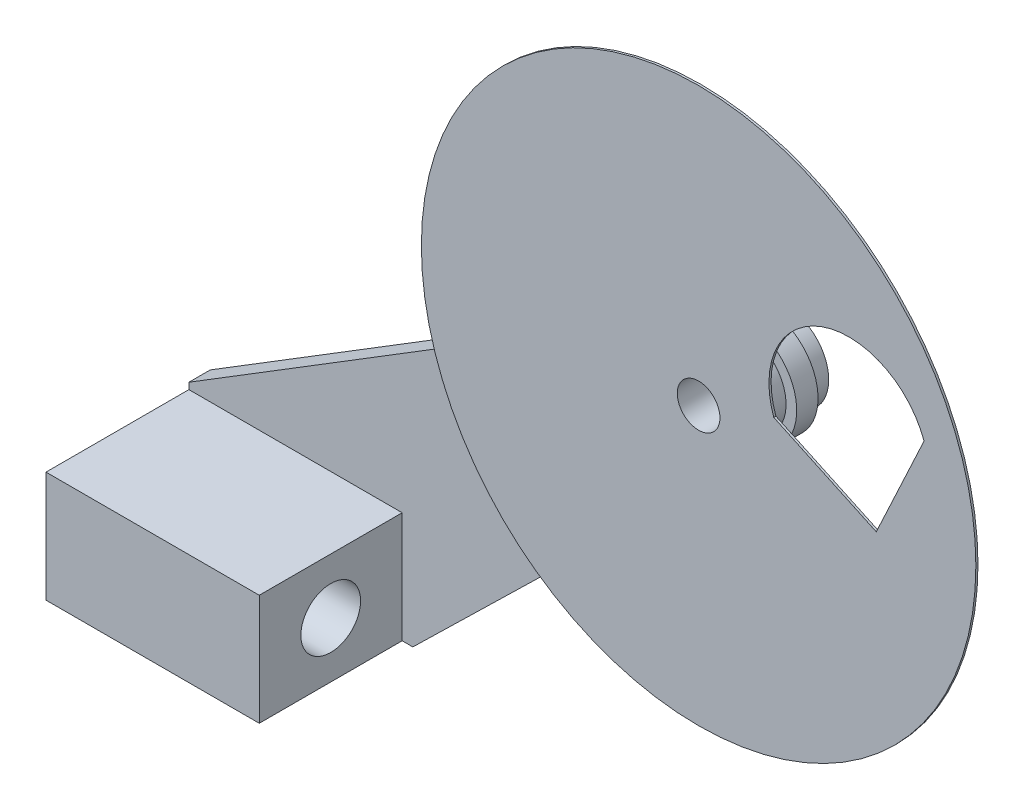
from build123d import *

# Parameters (mm, degrees)
ESQUISSE1_W             = 350
ESQUISSE1_H             = 240
BASE_EXTRUSION_DEPTH    = 10
ESQUISSE2_W             = 100
ESQUISSE2_H             = 52
BOSS_EXTRU_1_DEPTH      = 67
ESQUISSE3_R             = 14
ENL_V_MAT_EXTRU_1_DEPTH = 301.554487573
BOSS_EXTRU_2_DEPTH      = 20
BOSS_EXTRU_2_DEPTH_BACK = 20
ESQUISSE4_R             = 20
ENL_V_MAT_EXTRU_5_DEPTH = 291.644112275
ESQUISSE6_R             = 130
BOSS_EXTRU_3_DEPTH      = 1
ESQUISSE8_R             = 10
ENL_V_MAT_EXTRU_3_DEPTH = 331.607017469
ENL_V_MAT_EXTRU_4_REACH = 332.607


with BuildPart() as part:
    # Esquisse1 → Base-Extrusion (new body)
    with BuildSketch(Plane.XY):
        with Locations((66, -28)):
            Rectangle(ESQUISSE1_W, ESQUISSE1_H)
    extrude(amount=BASE_EXTRUSION_DEPTH)

    # Esquisse2 → Boss.-Extru.1 (add)
    with BuildSketch(Plane.XY.offset(10)):
        with Locations((-59, -122)):
            Rectangle(ESQUISSE2_W, ESQUISSE2_H)
    extrude(amount=BOSS_EXTRU_1_DEPTH)

    # Esquisse3 → Enl_v. mat.-Extru.1 (cut, through all)
    with BuildSketch(Plane(origin=(-9, 0, 0), x_dir=(0, 0, -1), z_dir=(1, 0, 0))):
        with Locations((-43.5, -122)):
            Circle(ESQUISSE3_R)
    extrude(amount=-ENL_V_MAT_EXTRU_1_DEPTH, mode=Mode.SUBTRACT)

    # Esquisse4 → Boss.-Extru.2 (add, two sides: drawn at the far end of the back side and taken through both)
    with BuildSketch(Plane.XY.offset(10).offset(-BOSS_EXTRU_2_DEPTH_BACK)):
        with Locations(Location((151, 38, 0), (0, 0, 180))):
            Circle(ESQUISSE4_R)
    extrude(amount=BOSS_EXTRU_2_DEPTH + BOSS_EXTRU_2_DEPTH_BACK)

    # Esquisse10 → Enl_v. mat.-Extru.5 (cut, through all)
    with BuildSketch(Plane.XY.offset(10)):
        with BuildLine():
            Line((-109, -93), (137.875411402, 59.27780943))
            ThreePointArc((137.875411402, 59.27780943), (170.709010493, 53.380341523), (168.450310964, 20.097859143))
            Line((168.450310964, 20.097859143), (-4, -148))
            Line((-4, -148), (241, -148))
            Line((241, -148), (241, 92))
            Line((241, 92), (-109, 92))
            Line((-109, 92), (-109, -93))
        make_face()
    extrude(amount=-ENL_V_MAT_EXTRU_5_DEPTH, mode=Mode.SUBTRACT)

    # Esquisse6 → Boss.-Extru.3 (add)
    with BuildSketch(Plane.XY.offset(30)):
        with Locations((151, 38)):
            Circle(ESQUISSE6_R)
    extrude(amount=BOSS_EXTRU_3_DEPTH)

    # Esquisse8 → Enl_v. mat.-Extru.3 (cut, through all)
    with BuildSketch(Plane.XY.offset(31)):
        with Locations((151, 38)):
            Circle(ESQUISSE8_R)
    extrude(amount=-ENL_V_MAT_EXTRU_3_DEPTH, mode=Mode.SUBTRACT)

    # Esquisse9 → Enl_v. mat.-Extru.4 (cut, up to next)
    with BuildSketch(Plane.XY.offset(31), mode=Mode.PRIVATE) as enl_v_mat_extru_4_sk1:
        with BuildLine():
            Line((256.715419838, 76.477266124), (234.302701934, 28.41303747))
            Line((234.302701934, 28.41303747), (186.238473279, 50.825755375))
            ThreePointArc((186.238473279, 50.825755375), (208.651191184, 98.889984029), (256.715419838, 76.477266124))
        make_face()
    enl_v_mat_extru_4_tool1 = extrude(enl_v_mat_extru_4_sk1.sketch, amount=-ENL_V_MAT_EXTRU_4_REACH, mode=Mode.PRIVATE) & part.part
    add(enl_v_mat_extru_4_tool1.solids().sort_by_distance((219.81394, 68.220584, 31))[0], mode=Mode.SUBTRACT)


solid = part.part
